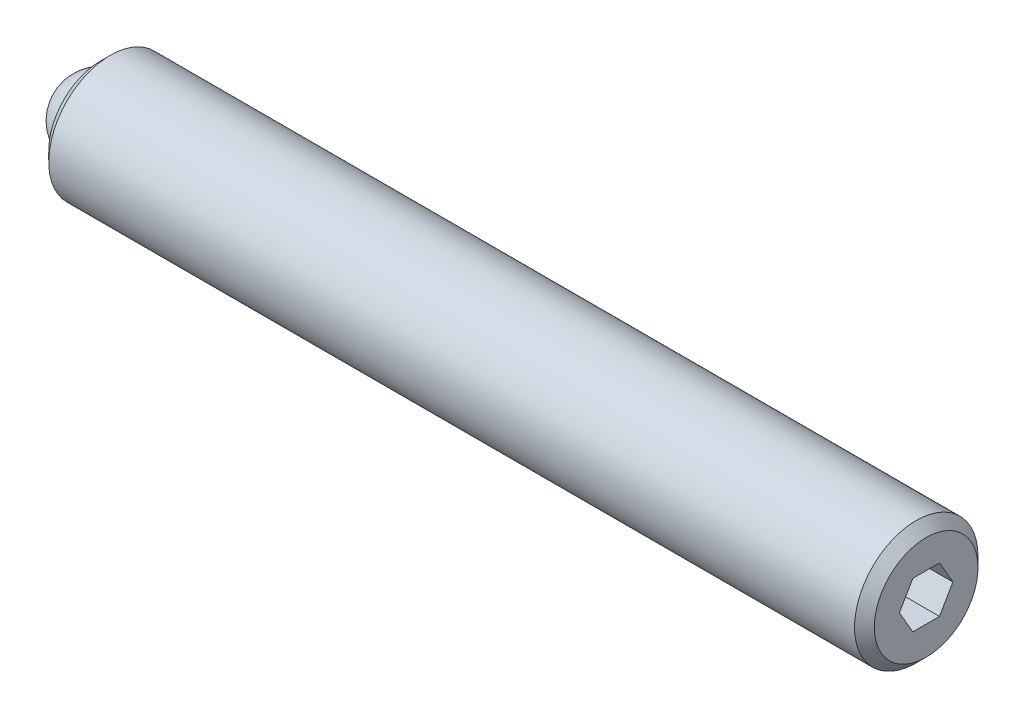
ISO-10303-21;
HEADER;
FILE_DESCRIPTION(('STEP AP214'),'2;1');
FILE_NAME('part.step','',(''),(''),'','','');
FILE_SCHEMA(('AUTOMOTIVE_DESIGN { 1 0 10303 214 1 1 1 1 }'));
ENDSEC;
DATA;
#1=APPLICATION_CONTEXT('core data for automotive mechanical design processes');
#2=APPLICATION_PROTOCOL_DEFINITION('international standard','automotive_design',2000,#1);
#3=PRODUCT_CONTEXT('',#1,'mechanical');
#4=PRODUCT('Part','Part','',(#3));
#5=PRODUCT_RELATED_PRODUCT_CATEGORY('part','',(#4));
#6=PRODUCT_DEFINITION_FORMATION('','',#4);
#7=PRODUCT_DEFINITION_CONTEXT('part definition',#1,'design');
#8=PRODUCT_DEFINITION('design','',#6,#7);
#9=PRODUCT_DEFINITION_SHAPE('','',#8);
#10=(LENGTH_UNIT() NAMED_UNIT(*) SI_UNIT(.MILLI.,.METRE.));
#11=(NAMED_UNIT(*) PLANE_ANGLE_UNIT() SI_UNIT($,.RADIAN.));
#12=(NAMED_UNIT(*) SI_UNIT($,.STERADIAN.) SOLID_ANGLE_UNIT());
#13=UNCERTAINTY_MEASURE_WITH_UNIT(LENGTH_MEASURE(1.E-05),#10,'distance_accuracy_value','');
#14=(GEOMETRIC_REPRESENTATION_CONTEXT(3) GLOBAL_UNCERTAINTY_ASSIGNED_CONTEXT((#13)) GLOBAL_UNIT_ASSIGNED_CONTEXT((#10,
#11,#12)) REPRESENTATION_CONTEXT('',''));
#15=CARTESIAN_POINT('',(0.,0.,0.));
#16=DIRECTION('',(0.,0.,1.));
#17=DIRECTION('',(1.,0.,0.));
#18=AXIS2_PLACEMENT_3D('',#15,#16,#17);
#19=CARTESIAN_POINT('',(0.,0.,0.));
#20=DIRECTION('',(0.,-1.,0.));
#21=DIRECTION('',(0.,0.,1.));
#22=AXIS2_PLACEMENT_3D('',#19,#20,#21);
#23=SPHERICAL_SURFACE('',#22,1.984375);
#24=CARTESIAN_POINT('',(0.,-1.984375,0.));
#25=VERTEX_POINT('',#24);
#26=VERTEX_LOOP('',#25);
#27=FACE_BOUND('',#26,.T.);
#28=ADVANCED_FACE('F41',(#27),#23,.T.);
#29=CLOSED_SHELL('',(#28));
#30=MANIFOLD_SOLID_BREP('B2',#29);
#31=CARTESIAN_POINT('',(42.465625,0.,0.));
#32=DIRECTION('',(-1.,0.,0.));
#33=DIRECTION('',(0.,0.,1.));
#34=AXIS2_PLACEMENT_3D('',#31,#32,#33);
#35=CYLINDRICAL_SURFACE('',#34,3.175);
#36=CARTESIAN_POINT('',(41.957625,0.,0.));
#37=DIRECTION('',(1.,0.,0.));
#38=DIRECTION('',(0.,0.,-1.));
#39=AXIS2_PLACEMENT_3D('',#36,#37,#38);
#40=CIRCLE('',#39,3.175);
#41=CARTESIAN_POINT('',(41.957625,0.,-3.175));
#42=VERTEX_POINT('',#41);
#43=EDGE_CURVE('E39',#42,#42,#40,.F.);
#44=ORIENTED_EDGE('',*,*,#43,.T.);
#45=EDGE_LOOP('',(#44));
#46=FACE_BOUND('',#45,.T.);
#47=CARTESIAN_POINT('',(0.507999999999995,0.,0.));
#48=DIRECTION('',(1.,0.,0.));
#49=DIRECTION('',(0.,0.,-1.));
#50=AXIS2_PLACEMENT_3D('',#47,#48,#49);
#51=CIRCLE('',#50,3.175);
#52=CARTESIAN_POINT('',(0.507999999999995,0.,-3.175));
#53=VERTEX_POINT('',#52);
#54=EDGE_CURVE('E157',#53,#53,#51,.T.);
#55=ORIENTED_EDGE('',*,*,#54,.T.);
#56=EDGE_LOOP('',(#55));
#57=FACE_BOUND('',#56,.T.);
#58=ADVANCED_FACE('F54',(#46,#57),#35,.T.);
#59=CARTESIAN_POINT('',(42.465625,0.,0.));
#60=DIRECTION('',(1.,0.,0.));
#61=DIRECTION('',(0.,0.,-1.));
#62=AXIS2_PLACEMENT_3D('',#59,#60,#61);
#63=PLANE('',#62);
#64=DIRECTION('',(0.,0.866025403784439,-0.5));
#65=VECTOR('',#64,1.);
#66=CARTESIAN_POINT('',(42.465625,-1.190625,-0.687407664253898));
#67=LINE('',#66,#65);
#68=CARTESIAN_POINT('',(42.465625,-1.190625,-0.687407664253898));
#69=VERTEX_POINT('',#68);
#70=CARTESIAN_POINT('',(42.465625,0.,-1.3748153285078));
#71=VERTEX_POINT('',#70);
#72=EDGE_CURVE('E69',#69,#71,#67,.T.);
#73=ORIENTED_EDGE('',*,*,#72,.F.);
#74=DIRECTION('',(0.,0.,-1.));
#75=VECTOR('',#74,1.);
#76=CARTESIAN_POINT('',(42.465625,-1.190625,0.687407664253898));
#77=LINE('',#76,#75);
#78=CARTESIAN_POINT('',(42.465625,-1.190625,0.687407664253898));
#79=VERTEX_POINT('',#78);
#80=EDGE_CURVE('E153',#79,#69,#77,.T.);
#81=ORIENTED_EDGE('',*,*,#80,.F.);
#82=DIRECTION('',(0.,-0.866025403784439,-0.5));
#83=VECTOR('',#82,1.);
#84=CARTESIAN_POINT('',(42.465625,0.,1.3748153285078));
#85=LINE('',#84,#83);
#86=CARTESIAN_POINT('',(42.465625,0.,1.3748153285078));
#87=VERTEX_POINT('',#86);
#88=EDGE_CURVE('E151',#87,#79,#85,.T.);
#89=ORIENTED_EDGE('',*,*,#88,.F.);
#90=DIRECTION('',(0.,-0.866025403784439,0.5));
#91=VECTOR('',#90,1.);
#92=CARTESIAN_POINT('',(42.465625,1.190625,0.687407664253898));
#93=LINE('',#92,#91);
#94=CARTESIAN_POINT('',(42.465625,1.190625,0.687407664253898));
#95=VERTEX_POINT('',#94);
#96=EDGE_CURVE('E117',#95,#87,#93,.T.);
#97=ORIENTED_EDGE('',*,*,#96,.F.);
#98=DIRECTION('',(0.,0.,1.));
#99=VECTOR('',#98,1.);
#100=CARTESIAN_POINT('',(42.465625,1.190625,-0.687407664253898));
#101=LINE('',#100,#99);
#102=CARTESIAN_POINT('',(42.465625,1.190625,-0.687407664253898));
#103=VERTEX_POINT('',#102);
#104=EDGE_CURVE('E147',#103,#95,#101,.T.);
#105=ORIENTED_EDGE('',*,*,#104,.F.);
#106=DIRECTION('',(0.,0.866025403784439,0.5));
#107=VECTOR('',#106,1.);
#108=CARTESIAN_POINT('',(42.465625,0.,-1.3748153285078));
#109=LINE('',#108,#107);
#110=EDGE_CURVE('E143',#71,#103,#109,.T.);
#111=ORIENTED_EDGE('',*,*,#110,.F.);
#112=EDGE_LOOP('',(#73,#81,#89,#97,#105,#111));
#113=FACE_BOUND('',#112,.T.);
#114=CARTESIAN_POINT('',(42.465625,0.,0.));
#115=DIRECTION('',(1.,0.,0.));
#116=DIRECTION('',(0.,0.,-1.));
#117=AXIS2_PLACEMENT_3D('',#114,#115,#116);
#118=CIRCLE('',#117,2.66700000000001);
#119=CARTESIAN_POINT('',(42.465625,0.,-2.66700000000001));
#120=VERTEX_POINT('',#119);
#121=EDGE_CURVE('E62',#120,#120,#118,.T.);
#122=ORIENTED_EDGE('',*,*,#121,.T.);
#123=EDGE_LOOP('',(#122));
#124=FACE_BOUND('',#123,.T.);
#125=ADVANCED_FACE('F170',(#113,#124),#63,.T.);
#126=CARTESIAN_POINT('',(0.,0.,0.));
#127=DIRECTION('',(1.,0.,0.));
#128=DIRECTION('',(0.,0.,-1.));
#129=AXIS2_PLACEMENT_3D('',#126,#127,#128);
#130=PLANE('',#129);
#131=CARTESIAN_POINT('',(0.,0.,0.));
#132=DIRECTION('',(-1.,0.,0.));
#133=DIRECTION('',(0.,0.,1.));
#134=AXIS2_PLACEMENT_3D('',#131,#132,#133);
#135=CIRCLE('',#134,1.9812);
#136=CARTESIAN_POINT('',(0.,0.,1.9812));
#137=VERTEX_POINT('',#136);
#138=EDGE_CURVE('E225',#137,#137,#135,.T.);
#139=ORIENTED_EDGE('',*,*,#138,.F.);
#140=EDGE_LOOP('',(#139));
#141=FACE_BOUND('',#140,.T.);
#142=CARTESIAN_POINT('',(0.,0.,0.));
#143=DIRECTION('',(1.,0.,0.));
#144=DIRECTION('',(0.,0.,-1.));
#145=AXIS2_PLACEMENT_3D('',#142,#143,#144);
#146=CIRCLE('',#145,2.667);
#147=CARTESIAN_POINT('',(0.,0.,-2.667));
#148=VERTEX_POINT('',#147);
#149=EDGE_CURVE('E165',#148,#148,#146,.F.);
#150=ORIENTED_EDGE('',*,*,#149,.T.);
#151=EDGE_LOOP('',(#150));
#152=FACE_BOUND('',#151,.T.);
#153=ADVANCED_FACE('F182',(#141,#152),#130,.F.);
#154=CARTESIAN_POINT('',(0.507999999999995,0.,0.));
#155=DIRECTION('',(1.,0.,0.));
#156=DIRECTION('',(0.,0.,-1.));
#157=AXIS2_PLACEMENT_3D('',#154,#155,#156);
#158=CONICAL_SURFACE('',#157,3.175,0.78539816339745);
#159=ORIENTED_EDGE('',*,*,#149,.F.);
#160=EDGE_LOOP('',(#159));
#161=FACE_BOUND('',#160,.T.);
#162=ORIENTED_EDGE('',*,*,#54,.F.);
#163=EDGE_LOOP('',(#162));
#164=FACE_BOUND('',#163,.T.);
#165=ADVANCED_FACE('F174',(#161,#164),#158,.T.);
#166=CARTESIAN_POINT('',(42.465625,0.,0.));
#167=DIRECTION('',(-1.,0.,0.));
#168=DIRECTION('',(0.,0.,1.));
#169=AXIS2_PLACEMENT_3D('',#166,#167,#168);
#170=CONICAL_SURFACE('',#169,2.66700000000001,0.785398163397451);
#171=ORIENTED_EDGE('',*,*,#43,.F.);
#172=EDGE_LOOP('',(#171));
#173=FACE_BOUND('',#172,.T.);
#174=ORIENTED_EDGE('',*,*,#121,.F.);
#175=EDGE_LOOP('',(#174));
#176=FACE_BOUND('',#175,.T.);
#177=ADVANCED_FACE('F56',(#173,#176),#170,.T.);
#178=CARTESIAN_POINT('',(40.179625,-1.190625,-0.687407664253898));
#179=DIRECTION('',(0.,-0.5,-0.866025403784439));
#180=DIRECTION('',(0.,0.866025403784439,-0.5));
#181=AXIS2_PLACEMENT_3D('',#178,#179,#180);
#182=PLANE('',#181);
#183=ORIENTED_EDGE('',*,*,#72,.T.);
#184=DIRECTION('',(1.,0.,0.));
#185=VECTOR('',#184,1.);
#186=CARTESIAN_POINT('',(40.179625,0.,-1.3748153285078));
#187=LINE('',#186,#185);
#188=CARTESIAN_POINT('',(40.179625,0.,-1.3748153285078));
#189=VERTEX_POINT('',#188);
#190=EDGE_CURVE('E99',#189,#71,#187,.T.);
#191=ORIENTED_EDGE('',*,*,#190,.F.);
#192=DIRECTION('',(0.,0.866025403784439,-0.5));
#193=VECTOR('',#192,1.);
#194=CARTESIAN_POINT('',(40.179625,-1.190625,-0.687407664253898));
#195=LINE('',#194,#193);
#196=CARTESIAN_POINT('',(40.179625,-1.190625,-0.687407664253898));
#197=VERTEX_POINT('',#196);
#198=EDGE_CURVE('E155',#197,#189,#195,.T.);
#199=ORIENTED_EDGE('',*,*,#198,.F.);
#200=DIRECTION('',(1.,0.,0.));
#201=VECTOR('',#200,1.);
#202=CARTESIAN_POINT('',(40.179625,-1.190625,-0.687407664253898));
#203=LINE('',#202,#201);
#204=EDGE_CURVE('E77',#197,#69,#203,.T.);
#205=ORIENTED_EDGE('',*,*,#204,.T.);
#206=EDGE_LOOP('',(#183,#191,#199,#205));
#207=FACE_BOUND('',#206,.T.);
#208=ADVANCED_FACE('F173',(#207),#182,.F.);
#209=CARTESIAN_POINT('',(40.179625,-1.190625,0.687407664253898));
#210=DIRECTION('',(0.,-1.,0.));
#211=DIRECTION('',(0.,0.,-1.));
#212=AXIS2_PLACEMENT_3D('',#209,#210,#211);
#213=PLANE('',#212);
#214=ORIENTED_EDGE('',*,*,#80,.T.);
#215=ORIENTED_EDGE('',*,*,#204,.F.);
#216=DIRECTION('',(0.,0.,-1.));
#217=VECTOR('',#216,1.);
#218=CARTESIAN_POINT('',(40.179625,-1.190625,0.687407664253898));
#219=LINE('',#218,#217);
#220=CARTESIAN_POINT('',(40.179625,-1.190625,0.687407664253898));
#221=VERTEX_POINT('',#220);
#222=EDGE_CURVE('E129',#221,#197,#219,.T.);
#223=ORIENTED_EDGE('',*,*,#222,.F.);
#224=DIRECTION('',(1.,0.,0.));
#225=VECTOR('',#224,1.);
#226=CARTESIAN_POINT('',(40.179625,-1.190625,0.687407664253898));
#227=LINE('',#226,#225);
#228=EDGE_CURVE('E121',#221,#79,#227,.T.);
#229=ORIENTED_EDGE('',*,*,#228,.T.);
#230=EDGE_LOOP('',(#214,#215,#223,#229));
#231=FACE_BOUND('',#230,.T.);
#232=ADVANCED_FACE('F180',(#231),#213,.F.);
#233=CARTESIAN_POINT('',(40.179625,0.,1.3748153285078));
#234=DIRECTION('',(0.,-0.5,0.866025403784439));
#235=DIRECTION('',(0.,-0.866025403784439,-0.5));
#236=AXIS2_PLACEMENT_3D('',#233,#234,#235);
#237=PLANE('',#236);
#238=ORIENTED_EDGE('',*,*,#88,.T.);
#239=ORIENTED_EDGE('',*,*,#228,.F.);
#240=DIRECTION('',(0.,-0.866025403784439,-0.5));
#241=VECTOR('',#240,1.);
#242=CARTESIAN_POINT('',(40.179625,0.,1.3748153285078));
#243=LINE('',#242,#241);
#244=CARTESIAN_POINT('',(40.179625,0.,1.3748153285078));
#245=VERTEX_POINT('',#244);
#246=EDGE_CURVE('E125',#245,#221,#243,.T.);
#247=ORIENTED_EDGE('',*,*,#246,.F.);
#248=DIRECTION('',(1.,0.,0.));
#249=VECTOR('',#248,1.);
#250=CARTESIAN_POINT('',(40.179625,0.,1.3748153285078));
#251=LINE('',#250,#249);
#252=EDGE_CURVE('E110',#245,#87,#251,.T.);
#253=ORIENTED_EDGE('',*,*,#252,.T.);
#254=EDGE_LOOP('',(#238,#239,#247,#253));
#255=FACE_BOUND('',#254,.T.);
#256=ADVANCED_FACE('F126',(#255),#237,.F.);
#257=CARTESIAN_POINT('',(40.179625,1.190625,0.687407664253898));
#258=DIRECTION('',(0.,0.5,0.866025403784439));
#259=DIRECTION('',(0.,-0.866025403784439,0.5));
#260=AXIS2_PLACEMENT_3D('',#257,#258,#259);
#261=PLANE('',#260);
#262=ORIENTED_EDGE('',*,*,#96,.T.);
#263=ORIENTED_EDGE('',*,*,#252,.F.);
#264=DIRECTION('',(0.,-0.866025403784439,0.5));
#265=VECTOR('',#264,1.);
#266=CARTESIAN_POINT('',(40.179625,1.190625,0.687407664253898));
#267=LINE('',#266,#265);
#268=CARTESIAN_POINT('',(40.179625,1.190625,0.687407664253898));
#269=VERTEX_POINT('',#268);
#270=EDGE_CURVE('E114',#269,#245,#267,.T.);
#271=ORIENTED_EDGE('',*,*,#270,.F.);
#272=DIRECTION('',(1.,0.,0.));
#273=VECTOR('',#272,1.);
#274=CARTESIAN_POINT('',(40.179625,1.190625,0.687407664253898));
#275=LINE('',#274,#273);
#276=EDGE_CURVE('E122',#269,#95,#275,.T.);
#277=ORIENTED_EDGE('',*,*,#276,.T.);
#278=EDGE_LOOP('',(#262,#263,#271,#277));
#279=FACE_BOUND('',#278,.T.);
#280=ADVANCED_FACE('F112',(#279),#261,.F.);
#281=CARTESIAN_POINT('',(40.179625,1.190625,-0.687407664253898));
#282=DIRECTION('',(0.,1.,0.));
#283=DIRECTION('',(0.,0.,1.));
#284=AXIS2_PLACEMENT_3D('',#281,#282,#283);
#285=PLANE('',#284);
#286=ORIENTED_EDGE('',*,*,#104,.T.);
#287=ORIENTED_EDGE('',*,*,#276,.F.);
#288=DIRECTION('',(0.,0.,1.));
#289=VECTOR('',#288,1.);
#290=CARTESIAN_POINT('',(40.179625,1.190625,-0.687407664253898));
#291=LINE('',#290,#289);
#292=CARTESIAN_POINT('',(40.179625,1.190625,-0.687407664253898));
#293=VERTEX_POINT('',#292);
#294=EDGE_CURVE('E135',#293,#269,#291,.T.);
#295=ORIENTED_EDGE('',*,*,#294,.F.);
#296=DIRECTION('',(1.,0.,0.));
#297=VECTOR('',#296,1.);
#298=CARTESIAN_POINT('',(40.179625,1.190625,-0.687407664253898));
#299=LINE('',#298,#297);
#300=EDGE_CURVE('E160',#293,#103,#299,.T.);
#301=ORIENTED_EDGE('',*,*,#300,.T.);
#302=EDGE_LOOP('',(#286,#287,#295,#301));
#303=FACE_BOUND('',#302,.T.);
#304=ADVANCED_FACE('F201',(#303),#285,.F.);
#305=CARTESIAN_POINT('',(40.179625,0.,-1.3748153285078));
#306=DIRECTION('',(0.,0.5,-0.866025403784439));
#307=DIRECTION('',(0.,0.866025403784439,0.5));
#308=AXIS2_PLACEMENT_3D('',#305,#306,#307);
#309=PLANE('',#308);
#310=ORIENTED_EDGE('',*,*,#110,.T.);
#311=ORIENTED_EDGE('',*,*,#300,.F.);
#312=DIRECTION('',(0.,0.866025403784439,0.5));
#313=VECTOR('',#312,1.);
#314=CARTESIAN_POINT('',(40.179625,0.,-1.3748153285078));
#315=LINE('',#314,#313);
#316=EDGE_CURVE('E137',#189,#293,#315,.T.);
#317=ORIENTED_EDGE('',*,*,#316,.F.);
#318=ORIENTED_EDGE('',*,*,#190,.T.);
#319=EDGE_LOOP('',(#310,#311,#317,#318));
#320=FACE_BOUND('',#319,.T.);
#321=ADVANCED_FACE('F198',(#320),#309,.F.);
#322=CARTESIAN_POINT('',(40.179625,0.,0.));
#323=DIRECTION('',(1.,0.,0.));
#324=DIRECTION('',(0.,0.,-1.));
#325=AXIS2_PLACEMENT_3D('',#322,#323,#324);
#326=PLANE('',#325);
#327=ORIENTED_EDGE('',*,*,#198,.T.);
#328=ORIENTED_EDGE('',*,*,#316,.T.);
#329=ORIENTED_EDGE('',*,*,#294,.T.);
#330=ORIENTED_EDGE('',*,*,#270,.T.);
#331=ORIENTED_EDGE('',*,*,#246,.T.);
#332=ORIENTED_EDGE('',*,*,#222,.T.);
#333=EDGE_LOOP('',(#327,#328,#329,#330,#331,#332));
#334=FACE_BOUND('',#333,.T.);
#335=ADVANCED_FACE('F132',(#334),#326,.T.);
#336=CARTESIAN_POINT('',(1.984375,0.,0.));
#337=DIRECTION('',(-1.,0.,0.));
#338=DIRECTION('',(0.,0.,1.));
#339=AXIS2_PLACEMENT_3D('',#336,#337,#338);
#340=CYLINDRICAL_SURFACE('',#339,1.9812);
#341=CARTESIAN_POINT('',(1.984375,0.,0.));
#342=DIRECTION('',(-1.,0.,0.));
#343=DIRECTION('',(0.,0.,1.));
#344=AXIS2_PLACEMENT_3D('',#341,#342,#343);
#345=CIRCLE('',#344,1.9812);
#346=CARTESIAN_POINT('',(1.984375,0.,1.9812));
#347=VERTEX_POINT('',#346);
#348=EDGE_CURVE('E144',#347,#347,#345,.T.);
#349=ORIENTED_EDGE('',*,*,#348,.F.);
#350=EDGE_LOOP('',(#349));
#351=FACE_BOUND('',#350,.T.);
#352=ORIENTED_EDGE('',*,*,#138,.T.);
#353=EDGE_LOOP('',(#352));
#354=FACE_BOUND('',#353,.T.);
#355=ADVANCED_FACE('F214',(#351,#354),#340,.F.);
#356=CARTESIAN_POINT('',(1.984375,0.,0.));
#357=DIRECTION('',(-1.,0.,0.));
#358=DIRECTION('',(0.,0.,1.));
#359=AXIS2_PLACEMENT_3D('',#356,#357,#358);
#360=PLANE('',#359);
#361=ORIENTED_EDGE('',*,*,#348,.T.);
#362=EDGE_LOOP('',(#361));
#363=FACE_BOUND('',#362,.T.);
#364=ADVANCED_FACE('F217',(#363),#360,.T.);
#365=CLOSED_SHELL('',(#58,#125,#153,#165,#177,#208,#232,#256,#280,#304,#321,#335,#355,#364));
#366=MANIFOLD_SOLID_BREP('B6',#365);
#367=ADVANCED_BREP_SHAPE_REPRESENTATION('',(#18,#30,#366),#14);
#368=SHAPE_DEFINITION_REPRESENTATION(#9,#367);
ENDSEC;
END-ISO-10303-21;
